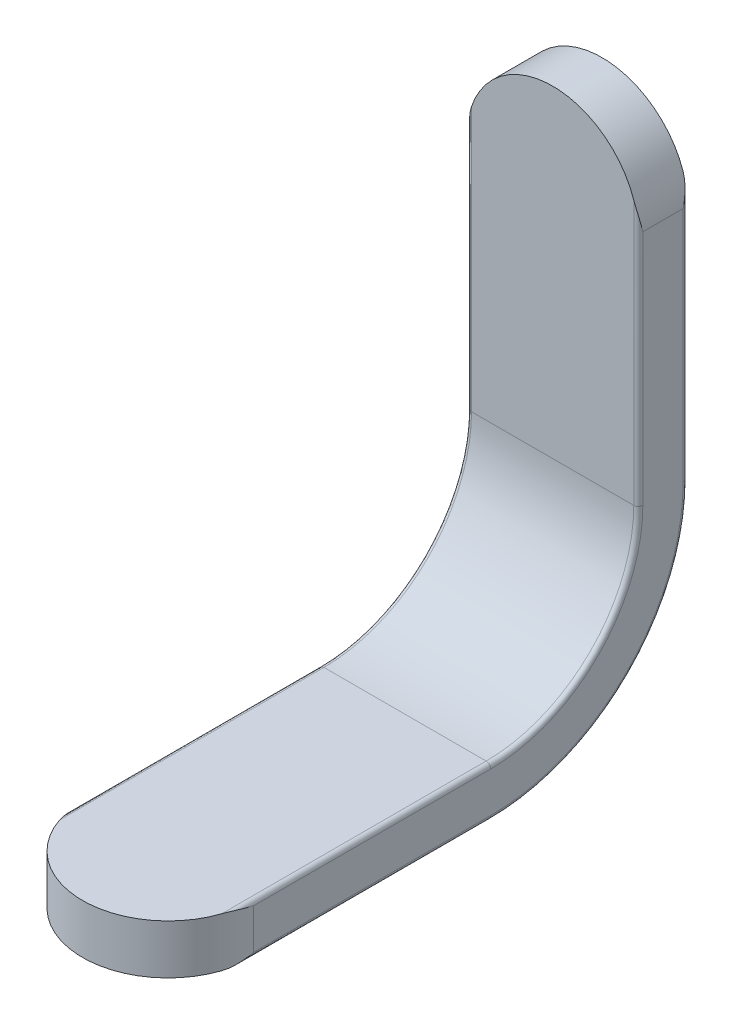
from build123d import *

# Parameters (mm, degrees)
EXTRUDE1_DEPTH     = 30
CUT_EXTRUDE1_DEPTH = 248.2854423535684
CUT_EXTRUDE2_DEPTH = 248.28544235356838


with BuildPart() as part:
    # Sketch1 → Extrude1 (new, symmetric)
    with BuildSketch(Plane(origin=(0, 0, 0), x_dir=(0, 0, -1), z_dir=(1, 0, 0))):
        with BuildLine():
            Line((1.322e-14, 182.00000000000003), (2.776e-14, 69.00000000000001))
            ThreePointArc((2.776e-14, 69.00000000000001), (-20.209632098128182, 20.209632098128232), (-68.99999999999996, 0))
            Line((-68.99999999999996, 0), (-181.99999999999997, -1.384e-14))
            Line((-181.99999999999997, -1.384e-14), (-181.99999999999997, 17.299999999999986))
            Line((-181.99999999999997, 17.299999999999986), (-68.99999999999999, 17.299999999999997))
            ThreePointArc((-68.99999999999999, 17.299999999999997), (-32.442579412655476, 32.44257941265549), (-17.299999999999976, 69))
            Line((-17.299999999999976, 69), (-17.300000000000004, 182.00000000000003))
            Line((-17.300000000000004, 182.00000000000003), (1.322e-14, 182.00000000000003))
        make_face()
    extrude(amount=EXTRUDE1_DEPTH, both=True)

    # Sketch2 → Cut-Extrude1 (cut, through all)
    with BuildSketch(Plane.XY.offset(17.299999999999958)):
        with BuildLine():
            Line((30, 152.00000000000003), (30, 183.00000000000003))
            Line((30, 183.00000000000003), (-30.000000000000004, 183.00000000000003))
            Line((-30.000000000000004, 183.00000000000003), (-30, 152.00000000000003))
            ThreePointArc((-30, 152.00000000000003), (1e-16, 182.00000000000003), (30, 152.00000000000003))
        make_face()
    extrude(amount=-CUT_EXTRUDE1_DEPTH, mode=Mode.SUBTRACT)

    # Sketch3 → Cut-Extrude2 (cut, through all)
    with BuildSketch(Plane(origin=(0, 17.300000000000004, 1.59e-15), x_dir=(-1, 0, 0), z_dir=(0, 1, 8e-17))):
        with BuildLine():
            Line((30, 151.99999999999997), (30, 182.99999999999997))
            Line((30, 182.99999999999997), (-30.000000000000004, 182.99999999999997))
            Line((-30.000000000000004, 182.99999999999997), (-30, 151.99999999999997))
            ThreePointArc((-30, 151.99999999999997), (7.04e-15, 181.99999999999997), (30, 151.99999999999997))
        make_face()
    extrude(amount=-CUT_EXTRUDE2_DEPTH, mode=Mode.SUBTRACT)

    # Cut-Sweep1: sweep along a path in Sketch4
    with BuildLine(Plane(origin=(0, 0, 0), x_dir=(0, 0, -1), z_dir=(1, 0, 0))) as cut_sweep1_path:
        Line((-181.99999999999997, 8.649999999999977), (-68.99999999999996, 8.649999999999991))
        ThreePointArc((-68.99999999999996, 8.649999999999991), (-26.326105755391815, 26.326105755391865), (-8.649999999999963, 69.00000000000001))
        Line((-8.649999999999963, 69.00000000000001), (-8.649999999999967, 182.00000000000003))
    # Sketch5 → Cut-Sweep1 (sweep, cut)
    with BuildSketch(Plane(origin=(0, 8.649999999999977, 181.99999999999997), x_dir=(1, 0, 0), z_dir=(0, 0, 1))):
        with BuildLine():
            Line((-28.410000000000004, 8.650000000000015), (-30.000000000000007, 8.650000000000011))
            Line((-30.000000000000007, 8.650000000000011), (-30.000000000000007, 7.060000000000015))
            ThreePointArc((-30.000000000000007, 7.060000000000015), (-29.534299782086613, 8.184299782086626), (-28.410000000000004, 8.650000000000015))
        make_face()
        with BuildLine():
            Line((-30.000000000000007, -8.650000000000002), (-30.000000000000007, -7.060000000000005))
            ThreePointArc((-30.000000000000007, -7.060000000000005), (-29.534299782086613, -8.184299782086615), (-28.410000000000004, -8.650000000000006))
            Line((-28.410000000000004, -8.650000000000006), (-30.000000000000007, -8.650000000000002))
        make_face()
        with BuildLine():
            Line((28.410000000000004, -8.650000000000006), (30.000000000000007, -8.650000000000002))
            Line((30.000000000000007, -8.650000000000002), (30.000000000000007, -7.060000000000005))
            ThreePointArc((30.000000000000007, -7.060000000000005), (29.534299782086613, -8.184299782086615), (28.410000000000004, -8.650000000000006))
        make_face()
        with BuildLine():
            Line((30.000000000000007, 8.650000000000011), (30.000000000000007, 7.060000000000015))
            ThreePointArc((30.000000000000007, 7.060000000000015), (29.534299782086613, 8.184299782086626), (28.410000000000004, 8.650000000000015))
            Line((28.410000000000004, 8.650000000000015), (30.000000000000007, 8.650000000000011))
        make_face()
    sweep(path=cut_sweep1_path.line, mode=Mode.SUBTRACT)


solid = part.part
